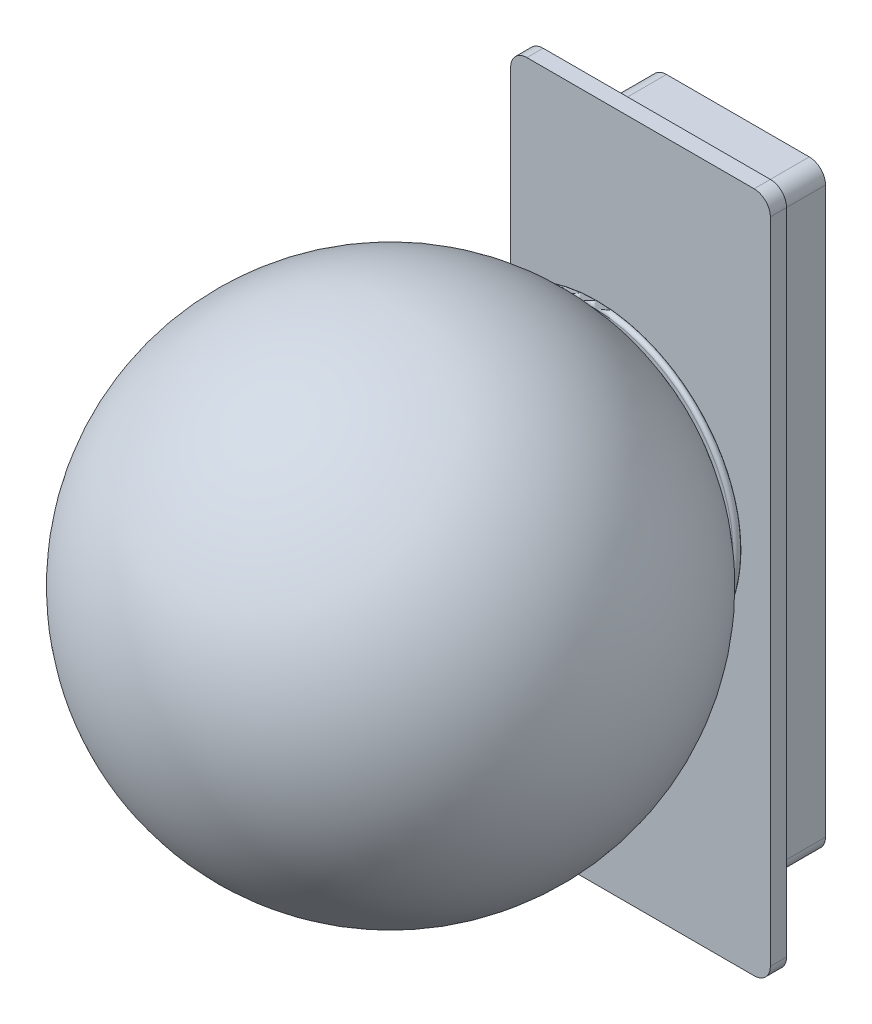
from build123d import *

# Parameters (mm, degrees)
SALIENTE_EXTRUIR1_DEPTH = 5
SALIENTE_EXTRUIR2_DEPTH = 25
CORTAR_EXTRUIR1_DEPTH   = 15


with BuildPart() as part:
    # Croquis1 → Saliente-Extruir1 (new body)
    with BuildSketch(Plane.XY):
        with BuildLine():
            Line((35, 105), (-35, 105))
            ThreePointArc((-35, 105), (-38.535533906, 103.535533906), (-40, 100))
            Line((-40, 100), (-40, -100))
            ThreePointArc((-40, -100), (-38.535533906, -103.535533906), (-35, -105))
            Line((-35, -105), (35, -105))
            ThreePointArc((35, -105), (38.535533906, -103.535533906), (40, -100))
            Line((40, -100), (40, 100))
            ThreePointArc((40, 100), (38.535533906, 103.535533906), (35, 105))
        make_face()
    extrude(amount=SALIENTE_EXTRUIR1_DEPTH)

    # Croquis2 → Saliente-Extruir2 (add)
    with BuildSketch(Plane(origin=(0, 0, 0), x_dir=(-1, 0, 0), z_dir=(0, 0, -1))):
        with BuildLine():
            Line((27, -87), (27, 87))
            ThreePointArc((27, 87), (25.535533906, 90.535533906), (22, 92))
            Line((22, 92), (-22, 92))
            ThreePointArc((-22, 92), (-25.535533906, 90.535533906), (-27, 87))
            Line((-27, 87), (-27, -87))
            ThreePointArc((-27, -87), (-25.535533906, -90.535533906), (-22, -92))
            Line((-22, -92), (22, -92))
            ThreePointArc((22, -92), (25.535533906, -90.535533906), (27, -87))
        make_face()
    extrude(amount=SALIENTE_EXTRUIR2_DEPTH)

    # Croquis4 → Cortar-Extruir1 (cut)
    with BuildSketch(Plane(origin=(0, 0, -25), x_dir=(-1, 0, 0), z_dir=(0, 0, -1))):
        with BuildLine():
            Line((24, -87), (24, 87))
            ThreePointArc((24, 87), (23.414213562, 88.414213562), (22, 89))
            Line((22, 89), (-22, 89))
            ThreePointArc((-22, 89), (-23.414213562, 88.414213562), (-24, 87))
            Line((-24, 87), (-24, -87))
            ThreePointArc((-24, -87), (-23.414213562, -88.414213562), (-22, -89))
            Line((-22, -89), (22, -89))
            ThreePointArc((22, -89), (23.414213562, -88.414213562), (24, -87))
        make_face()
    extrude(amount=-CORTAR_EXTRUIR1_DEPTH, mode=Mode.SUBTRACT)


with BuildPart() as body_2:
    # Croquis3 → Revoluci_n2 (revolve)
    with BuildSketch(Plane(origin=(0, 0, 0), x_dir=(0, 0, -1), z_dir=(1, 0, 0)), mode=Mode.PRIVATE) as revoluci_n2_sk:
        with BuildLine():
            Line((-20.170511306, 63.674688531), (-20.170511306, 62.451317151))
            ThreePointArc((-20.170511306, 62.451317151), (-104.223729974, 91.631737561), (-157, 20))
            Line((-157, 20), (-5, 20))
            ThreePointArc((-5, 20), (-8.406847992, 43.097382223), (-18.337226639, 64.227532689))
            ThreePointArc((-18.337226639, 64.227532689), (-19.459228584, 64.632102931), (-20.170511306, 63.674688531))
        make_face()
    revolve(revoluci_n2_sk.sketch.rotate(Axis((0, 20, 5), (0, 0, 1)), 90), axis=Axis((0, 20, 5), (0, 0, 1)))


solid = Compound([part.part, body_2.part])
